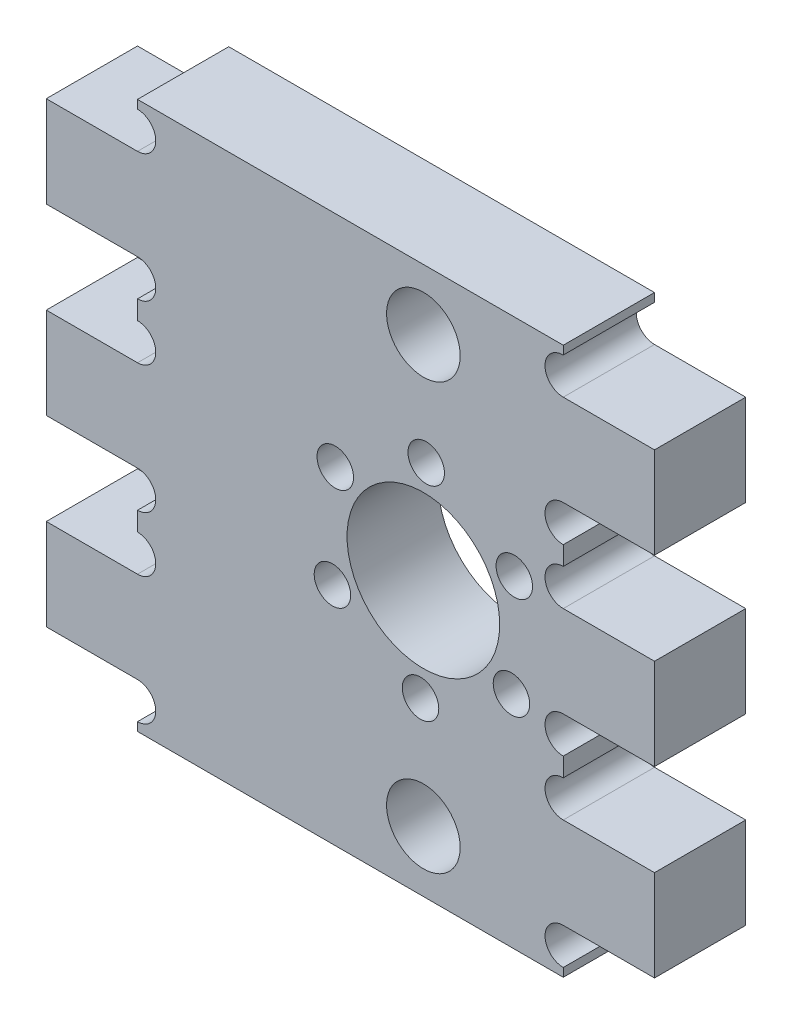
from build123d import *

# Parameters (mm, degrees)
OUTLINE_DEPTH = 15
SKIZZE2_R     = 6.05
SKIZZE2_R_2   = 12.55
INNER_DEPTH   = 15
SKIZZE3_R     = 3
HOLES_DEPTH   = 20


with BuildPart() as part:
    # Skizze1 → outline (new body)
    with BuildSketch(Plane.XY):
        with BuildLine():
            Line((96.588113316, 0), (26.588113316, 0))
            Line((26.588113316, 0), (26.588113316, 1.4))
            ThreePointArc((26.588113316, 1.4), (29.588113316, 4.4), (26.588113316, 7.4))
            Line((26.588113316, 7.4), (11.588113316, 7.4))
            Line((11.588113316, 7.4), (11.588113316, 22.4))
            Line((11.588113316, 22.4), (26.588113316, 22.4))
            ThreePointArc((26.588113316, 22.4), (29.588113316, 25.4), (26.588113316, 28.4))
            Line((26.588113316, 28.4), (26.588113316, 31.5))
            ThreePointArc((26.588113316, 31.5), (29.588113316, 34.5), (26.588113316, 37.5))
            Line((26.588113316, 37.5), (11.588113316, 37.5))
            Line((11.588113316, 37.5), (11.588113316, 52.5))
            Line((11.588113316, 52.5), (26.588113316, 52.5))
            ThreePointArc((26.588113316, 52.5), (29.588113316, 55.5), (26.588113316, 58.5))
            Line((26.588113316, 58.5), (26.588113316, 61.6))
            ThreePointArc((26.588113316, 61.6), (29.588113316, 64.6), (26.588113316, 67.6))
            Line((26.588113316, 67.6), (11.588113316, 67.6))
            Line((11.588113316, 67.6), (11.588113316, 82.6))
            Line((11.588113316, 82.6), (26.588113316, 82.6))
            ThreePointArc((26.588113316, 82.6), (29.588113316, 85.6), (26.588113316, 88.6))
            Line((26.588113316, 88.6), (26.588113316, 90))
            Line((26.588113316, 90), (96.588113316, 90))
            Line((96.588113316, 90), (96.588113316, 88.6))
            ThreePointArc((96.588113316, 88.6), (93.588113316, 85.6), (96.588113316, 82.6))
            Line((96.588113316, 82.6), (111.588113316, 82.6))
            Line((111.588113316, 82.6), (111.588113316, 67.6))
            Line((111.588113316, 67.6), (96.588113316, 67.6))
            ThreePointArc((96.588113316, 67.6), (93.588113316, 64.6), (96.588113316, 61.6))
            Line((96.588113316, 61.6), (96.588113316, 58.5))
            ThreePointArc((96.588113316, 58.5), (93.588113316, 55.5), (96.588113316, 52.5))
            Line((96.588113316, 52.5), (111.588113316, 52.5))
            Line((111.588113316, 52.5), (111.588113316, 37.5))
            Line((111.588113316, 37.5), (96.588113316, 37.5))
            ThreePointArc((96.588113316, 37.5), (93.588113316, 34.5), (96.588113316, 31.5))
            Line((96.588113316, 31.5), (96.588113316, 28.4))
            ThreePointArc((96.588113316, 28.4), (93.588113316, 25.4), (96.588113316, 22.4))
            Line((96.588113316, 22.4), (111.588113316, 22.4))
            Line((111.588113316, 22.4), (111.588113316, 7.4))
            Line((111.588113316, 7.4), (96.588113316, 7.4))
            ThreePointArc((96.588113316, 7.4), (93.588113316, 4.4), (96.588113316, 1.4))
            Line((96.588113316, 1.4), (96.588113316, 0))
        make_face()
    extrude(amount=OUTLINE_DEPTH)

    # Skizze2 → inner (cut)
    with BuildSketch(Plane.XY.offset(15)):
        with Locations((73.588113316, 80)):
            Circle(SKIZZE2_R)
        with Locations((73.588113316, 45)):
            Circle(SKIZZE2_R_2)
        with Locations((73.588113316, 10)):
            Circle(SKIZZE2_R)
    extrude(amount=-INNER_DEPTH, mode=Mode.SUBTRACT)

    # Skizze3 → holes (cut)
    with BuildSketch(Plane(origin=(0, 0, 0), x_dir=(-1, 0, 0), z_dir=(0, 0, -1))):
        with Locations((-74.056416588, 61.993548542)):
            Circle(SKIZZE3_R)
        with Locations((-59.105420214, 53.902336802)):
            Circle(SKIZZE3_R)
        with Locations((-58.637116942, 36.90878826)):
            Circle(SKIZZE3_R)
        with Locations((-73.119810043, 28.006451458)):
            Circle(SKIZZE3_R)
        with Locations((-88.070806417, 36.097663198)):
            Circle(SKIZZE3_R)
        with Locations((-88.53910969, 53.09121174)):
            Circle(SKIZZE3_R)
    extrude(amount=-HOLES_DEPTH, mode=Mode.SUBTRACT)


solid = part.part
